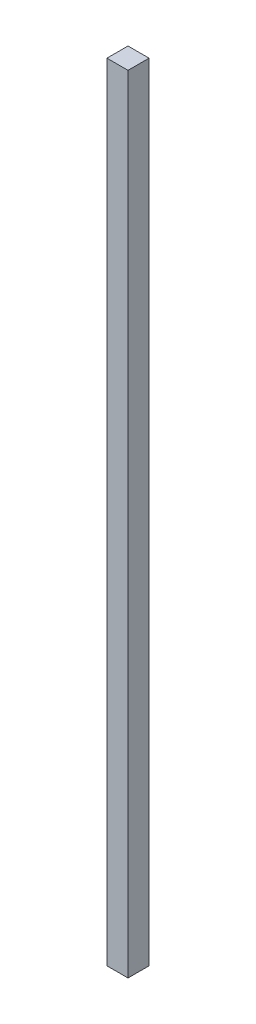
ISO-10303-21;
HEADER;
FILE_DESCRIPTION(('STEP AP214'),'2;1');
FILE_NAME('part.step','',(''),(''),'','','');
FILE_SCHEMA(('AUTOMOTIVE_DESIGN { 1 0 10303 214 1 1 1 1 }'));
ENDSEC;
DATA;
#1=APPLICATION_CONTEXT('core data for automotive mechanical design processes');
#2=APPLICATION_PROTOCOL_DEFINITION('international standard','automotive_design',2000,#1);
#3=PRODUCT_CONTEXT('',#1,'mechanical');
#4=PRODUCT('Part','Part','',(#3));
#5=PRODUCT_RELATED_PRODUCT_CATEGORY('part','',(#4));
#6=PRODUCT_DEFINITION_FORMATION('','',#4);
#7=PRODUCT_DEFINITION_CONTEXT('part definition',#1,'design');
#8=PRODUCT_DEFINITION('design','',#6,#7);
#9=PRODUCT_DEFINITION_SHAPE('','',#8);
#10=(LENGTH_UNIT() NAMED_UNIT(*) SI_UNIT(.MILLI.,.METRE.));
#11=(NAMED_UNIT(*) PLANE_ANGLE_UNIT() SI_UNIT($,.RADIAN.));
#12=(NAMED_UNIT(*) SI_UNIT($,.STERADIAN.) SOLID_ANGLE_UNIT());
#13=UNCERTAINTY_MEASURE_WITH_UNIT(LENGTH_MEASURE(1.E-05),#10,'distance_accuracy_value','');
#14=(GEOMETRIC_REPRESENTATION_CONTEXT(3) GLOBAL_UNCERTAINTY_ASSIGNED_CONTEXT((#13)) GLOBAL_UNIT_ASSIGNED_CONTEXT((#10,
#11,#12)) REPRESENTATION_CONTEXT('',''));
#15=CARTESIAN_POINT('',(0.,0.,0.));
#16=DIRECTION('',(0.,0.,1.));
#17=DIRECTION('',(1.,0.,0.));
#18=AXIS2_PLACEMENT_3D('',#15,#16,#17);
#19=CARTESIAN_POINT('',(30.,2240.,-30.));
#20=DIRECTION('',(-1.,0.,0.));
#21=DIRECTION('',(0.,0.,1.));
#22=AXIS2_PLACEMENT_3D('',#19,#20,#21);
#23=PLANE('',#22);
#24=DIRECTION('',(0.,0.,-1.));
#25=VECTOR('',#24,1.);
#26=CARTESIAN_POINT('',(30.,0.,-30.));
#27=LINE('',#26,#25);
#28=CARTESIAN_POINT('',(30.,0.,30.));
#29=VERTEX_POINT('',#28);
#30=CARTESIAN_POINT('',(30.,0.,-30.));
#31=VERTEX_POINT('',#30);
#32=EDGE_CURVE('E113',#29,#31,#27,.T.);
#33=ORIENTED_EDGE('',*,*,#32,.T.);
#34=DIRECTION('',(0.,-1.,0.));
#35=VECTOR('',#34,1.);
#36=CARTESIAN_POINT('',(30.,2240.,-30.));
#37=LINE('',#36,#35);
#38=CARTESIAN_POINT('',(30.,2240.,-30.));
#39=VERTEX_POINT('',#38);
#40=EDGE_CURVE('E11',#39,#31,#37,.T.);
#41=ORIENTED_EDGE('',*,*,#40,.F.);
#42=DIRECTION('',(0.,0.,-1.));
#43=VECTOR('',#42,1.);
#44=CARTESIAN_POINT('',(30.,2240.,-30.));
#45=LINE('',#44,#43);
#46=CARTESIAN_POINT('',(30.,2240.,30.));
#47=VERTEX_POINT('',#46);
#48=EDGE_CURVE('E97',#47,#39,#45,.T.);
#49=ORIENTED_EDGE('',*,*,#48,.F.);
#50=DIRECTION('',(0.,-1.,0.));
#51=VECTOR('',#50,1.);
#52=CARTESIAN_POINT('',(30.,2240.,30.));
#53=LINE('',#52,#51);
#54=EDGE_CURVE('E109',#47,#29,#53,.T.);
#55=ORIENTED_EDGE('',*,*,#54,.T.);
#56=EDGE_LOOP('',(#33,#41,#49,#55));
#57=FACE_BOUND('',#56,.T.);
#58=ADVANCED_FACE('F45',(#57),#23,.F.);
#59=CARTESIAN_POINT('',(-30.,2240.,-30.));
#60=DIRECTION('',(0.,0.,1.));
#61=DIRECTION('',(1.,0.,0.));
#62=AXIS2_PLACEMENT_3D('',#59,#60,#61);
#63=PLANE('',#62);
#64=DIRECTION('',(-1.,0.,0.));
#65=VECTOR('',#64,1.);
#66=CARTESIAN_POINT('',(-30.,0.,-30.));
#67=LINE('',#66,#65);
#68=CARTESIAN_POINT('',(-30.,0.,-30.));
#69=VERTEX_POINT('',#68);
#70=EDGE_CURVE('E102',#31,#69,#67,.T.);
#71=ORIENTED_EDGE('',*,*,#70,.T.);
#72=DIRECTION('',(0.,-1.,0.));
#73=VECTOR('',#72,1.);
#74=CARTESIAN_POINT('',(-30.,2240.,-30.));
#75=LINE('',#74,#73);
#76=CARTESIAN_POINT('',(-30.,2240.,-30.));
#77=VERTEX_POINT('',#76);
#78=EDGE_CURVE('E54',#77,#69,#75,.T.);
#79=ORIENTED_EDGE('',*,*,#78,.F.);
#80=DIRECTION('',(-1.,0.,0.));
#81=VECTOR('',#80,1.);
#82=CARTESIAN_POINT('',(-30.,2240.,-30.));
#83=LINE('',#82,#81);
#84=EDGE_CURVE('E92',#39,#77,#83,.T.);
#85=ORIENTED_EDGE('',*,*,#84,.F.);
#86=ORIENTED_EDGE('',*,*,#40,.T.);
#87=EDGE_LOOP('',(#71,#79,#85,#86));
#88=FACE_BOUND('',#87,.T.);
#89=ADVANCED_FACE('F101',(#88),#63,.F.);
#90=CARTESIAN_POINT('',(-30.,2240.,-30.));
#91=DIRECTION('',(1.,0.,0.));
#92=DIRECTION('',(0.,0.,-1.));
#93=AXIS2_PLACEMENT_3D('',#90,#91,#92);
#94=PLANE('',#93);
#95=DIRECTION('',(0.,0.,1.));
#96=VECTOR('',#95,1.);
#97=CARTESIAN_POINT('',(-30.,0.,-30.));
#98=LINE('',#97,#96);
#99=CARTESIAN_POINT('',(-30.,0.,30.));
#100=VERTEX_POINT('',#99);
#101=EDGE_CURVE('E79',#69,#100,#98,.T.);
#102=ORIENTED_EDGE('',*,*,#101,.T.);
#103=DIRECTION('',(0.,-1.,0.));
#104=VECTOR('',#103,1.);
#105=CARTESIAN_POINT('',(-30.,2240.,30.));
#106=LINE('',#105,#104);
#107=CARTESIAN_POINT('',(-30.,2240.,30.));
#108=VERTEX_POINT('',#107);
#109=EDGE_CURVE('E104',#108,#100,#106,.T.);
#110=ORIENTED_EDGE('',*,*,#109,.F.);
#111=DIRECTION('',(0.,0.,1.));
#112=VECTOR('',#111,1.);
#113=CARTESIAN_POINT('',(-30.,2240.,-30.));
#114=LINE('',#113,#112);
#115=EDGE_CURVE('E95',#77,#108,#114,.T.);
#116=ORIENTED_EDGE('',*,*,#115,.F.);
#117=ORIENTED_EDGE('',*,*,#78,.T.);
#118=EDGE_LOOP('',(#102,#110,#116,#117));
#119=FACE_BOUND('',#118,.T.);
#120=ADVANCED_FACE('F105',(#119),#94,.F.);
#121=CARTESIAN_POINT('',(-30.,2240.,30.));
#122=DIRECTION('',(0.,0.,-1.));
#123=DIRECTION('',(-1.,0.,0.));
#124=AXIS2_PLACEMENT_3D('',#121,#122,#123);
#125=PLANE('',#124);
#126=DIRECTION('',(1.,0.,0.));
#127=VECTOR('',#126,1.);
#128=CARTESIAN_POINT('',(-30.,0.,30.));
#129=LINE('',#128,#127);
#130=EDGE_CURVE('E85',#100,#29,#129,.T.);
#131=ORIENTED_EDGE('',*,*,#130,.T.);
#132=ORIENTED_EDGE('',*,*,#54,.F.);
#133=DIRECTION('',(1.,0.,0.));
#134=VECTOR('',#133,1.);
#135=CARTESIAN_POINT('',(-30.,2240.,30.));
#136=LINE('',#135,#134);
#137=EDGE_CURVE('E62',#108,#47,#136,.T.);
#138=ORIENTED_EDGE('',*,*,#137,.F.);
#139=ORIENTED_EDGE('',*,*,#109,.T.);
#140=EDGE_LOOP('',(#131,#132,#138,#139));
#141=FACE_BOUND('',#140,.T.);
#142=ADVANCED_FACE('F126',(#141),#125,.F.);
#143=CARTESIAN_POINT('',(0.,2240.,0.));
#144=DIRECTION('',(0.,1.,0.));
#145=DIRECTION('',(0.,0.,1.));
#146=AXIS2_PLACEMENT_3D('',#143,#144,#145);
#147=PLANE('',#146);
#148=ORIENTED_EDGE('',*,*,#48,.T.);
#149=ORIENTED_EDGE('',*,*,#84,.T.);
#150=ORIENTED_EDGE('',*,*,#115,.T.);
#151=ORIENTED_EDGE('',*,*,#137,.T.);
#152=EDGE_LOOP('',(#148,#149,#150,#151));
#153=FACE_BOUND('',#152,.T.);
#154=ADVANCED_FACE('F93',(#153),#147,.T.);
#155=CARTESIAN_POINT('',(0.,0.,0.));
#156=DIRECTION('',(0.,1.,0.));
#157=DIRECTION('',(0.,0.,1.));
#158=AXIS2_PLACEMENT_3D('',#155,#156,#157);
#159=PLANE('',#158);
#160=ORIENTED_EDGE('',*,*,#32,.F.);
#161=ORIENTED_EDGE('',*,*,#130,.F.);
#162=ORIENTED_EDGE('',*,*,#101,.F.);
#163=ORIENTED_EDGE('',*,*,#70,.F.);
#164=EDGE_LOOP('',(#160,#161,#162,#163));
#165=FACE_BOUND('',#164,.T.);
#166=ADVANCED_FACE('F129',(#165),#159,.F.);
#167=CLOSED_SHELL('',(#58,#89,#120,#142,#154,#166));
#168=MANIFOLD_SOLID_BREP('B2',#167);
#169=ADVANCED_BREP_SHAPE_REPRESENTATION('',(#18,#168),#14);
#170=SHAPE_DEFINITION_REPRESENTATION(#9,#169);
ENDSEC;
END-ISO-10303-21;
